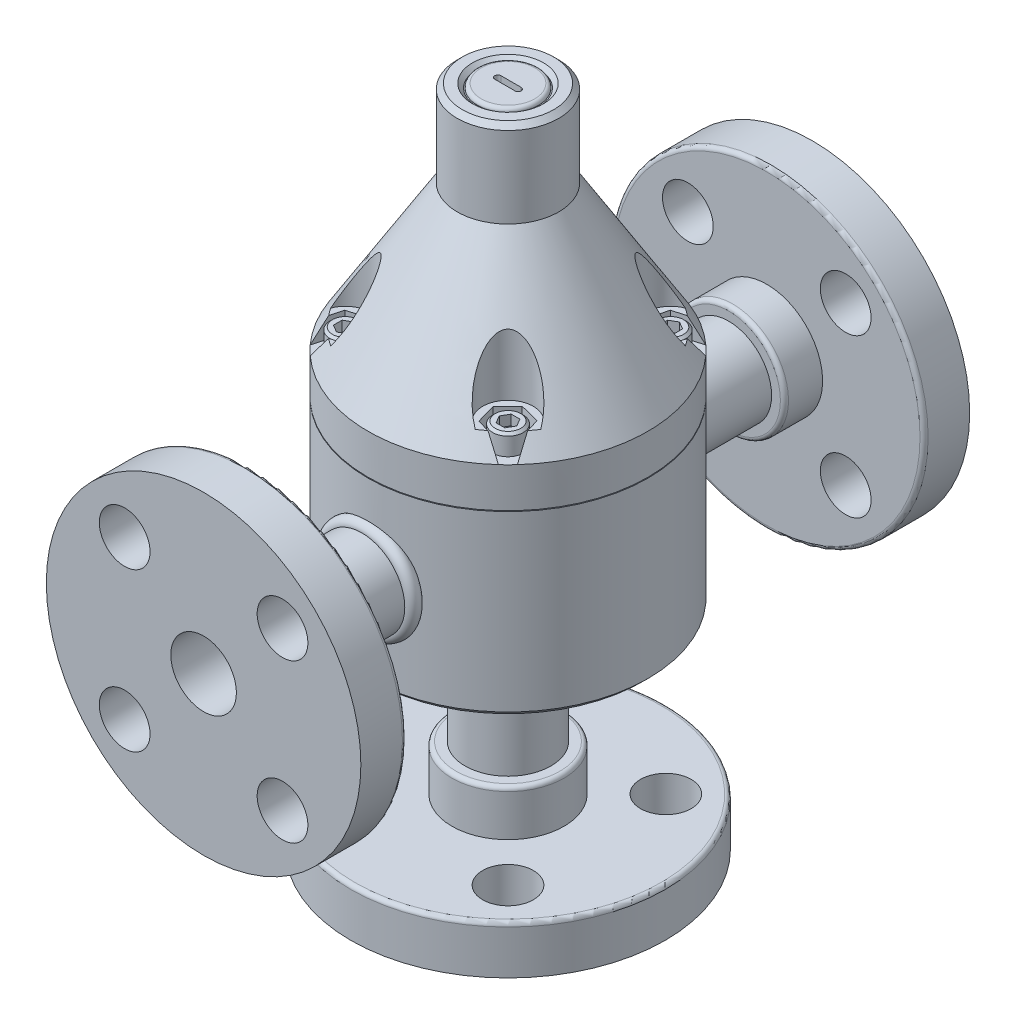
from build123d import *

# Parameters (mm, degrees)
SKETCH1_R                = 43.815
EXTRUDE1_DEPTH           = 140.97
SKETCH3_R                = 11.1125
EXTRUDE2_DEPTH           = 1.27
EXTRUDE2_DRAFT           = -45
CHAMFER1_SIZE            = 1.5748
SKETCH4_R                = 9.525
EXTRUDE3_DEPTH           = 1.27
FILLET1_R                = 1.143
EXTRUDE4_DEPTH           = 3.302
EXTRUDE4_DRAFT           = -1
SKETCH6_R                = 7.9375
EXTRUDE5_DEPTH           = 22.86
EXTRUDE6_DEPTH           = 6.35
CIRPATTERN1_COUNT        = 4
SKETCH9_R                = 4.7625
EXTRUDE7_DEPTH           = 6.35
EXTRUDE8_DEPTH           = 3.175
CIRPATTERN2_COUNT        = 4
CHAMFER2_SIZE            = 0.762
SKETCH11_R               = 49.2125
BOSS_EXTRUDE1_DEPTH      = 14.2748
SKETCH12_R               = 17.4625
BOSS_EXTRUDE2_DEPTH      = 26.2128
BOSS_EXTRUDE3_REACH      = 206.043
BOSS_EXTRUDE3_END_RADIUS = 43.815
SKETCH13_R               = 13.4366
SKETCH14_R               = 10.2616
CUT_EXTRUDE1_DEPTH       = 25.4
SKETCH15_R               = 7.9375
CUT_EXTRUDE2_DEPTH       = 25.4
CIRPATTERN3_COUNT        = 4
SKETCH18_R               = 49.2125
BOSS_EXTRUDE5_DEPTH      = 14.2748
BOSS_EXTRUDE6_START      = 26.2128
SKETCH19_R               = 17.4625
BOSS_EXTRUDE6_DEPTH      = 26.2128
BOSS_EXTRUDE7_REACH      = 244.043
BOSS_EXTRUDE7_END_RADIUS = 43.815
SKETCH20_R               = 13.4366
CUT_EXTRUDE3_START       = 25.4
SKETCH21_R               = 10.2616
CUT_EXTRUDE3_DEPTH       = 25.4
CUT_EXTRUDE4_START       = 25.4
SKETCH22_R               = 7.9375
CUT_EXTRUDE4_DEPTH       = 25.4
CIRPATTERN4_COUNT        = 4
FILLET3_R                = 1.27
SKETCH23_R               = 49.2125
BOSS_EXTRUDE8_DEPTH      = 15.0622
SKETCH24_R               = 17.526
BOSS_EXTRUDE9_DEPTH      = 29.3624
SKETCH25_R               = 13.4366
BOSS_EXTRUDE10_DEPTH     = 66.675
SKETCH26_R               = 10.2616
CUT_EXTRUDE5_DEPTH       = 25.4
FILLET4_R                = 1.27
SKETCH27_R               = 7.9375
CUT_EXTRUDE6_DEPTH       = 25.4
CIRPATTERN5_COUNT        = 4


with BuildPart() as part:
    # Sketch1 → Extrude1 (new body)
    with BuildSketch(Plane(origin=(0, 0, 0), x_dir=(1, 0, 0), z_dir=(0, 1, 0))):
        with Locations(Location((0, 0, 0), (0, 0, 270))):
            Circle(SKETCH1_R)
    extrude(amount=EXTRUDE1_DEPTH)

    # Sketch2 → Cut-Revolve1 (revolve, cut)
    with BuildSketch(Plane.XY, mode=Mode.PRIVATE) as cut_revolve1_sk:
        Polygon((-43.815, 56.134), (-43.815, 68.58), (-15.875, 114.046), (-15.875, 147.034008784), (-49.44729897, 147.034008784), (-49.44729897, 55.88), (-30.226, 55.88), (-30.226, 56.134), align=None)
    revolve(cut_revolve1_sk.sketch.rotate(Axis((0, 0, 0), (0, 1, 0)), 270), axis=Axis((0, 0, 0), (0, 1, 0)), mode=Mode.SUBTRACT)


with BuildPart() as extrude2_tool:
    # Sketch3 → Extrude2 (with draft: the straight prism first)
    with BuildSketch(Plane(origin=(0, 140.97, 0), x_dir=(-1, 0, 0), z_dir=(0, 1, 0))):
        Circle(SKETCH3_R)
    extrude(amount=-EXTRUDE2_DEPTH)
    # Extrude2: the draft: its side faces are tilted about the plane it starts from
    extrude2_sides = [extrude2_tool.faces().sort_by_distance(p)[0] for p in [
        (11.1125, 140.335, 0),
    ]]
    draft(extrude2_sides, Plane(origin=(0, 140.97, 0), x_dir=(-1, 0, 0), z_dir=(0, 1, 0)), EXTRUDE2_DRAFT)


with BuildPart() as part_1:
    add(part.part)

    # Extrude2: cut by extrude2_tool
    add(extrude2_tool.part, mode=Mode.SUBTRACT)

    # Chamfer1
    chamfer1_edges = [part_1.edges().sort_by_distance(p)[0] for p in [
        (0, 0, -43.815),
        (0, 140.97, 15.875),
    ]]
    chamfer(chamfer1_edges, length=CHAMFER1_SIZE)

    # Sketch4 → Extrude3 (add)
    with BuildSketch(Plane(origin=(0, 140.97, 0), x_dir=(-1, 0, 0), z_dir=(0, 1, 0))):
        with Locations(Location((0, 0, 0), (0, 0, 90))):
            Circle(SKETCH4_R)
    extrude(amount=-EXTRUDE3_DEPTH)

    # Fillet1
    fillet1_edges = [part_1.edges().sort_by_distance(p)[0] for p in [
        (0, 140.97, -9.525),
    ]]
    fillet(fillet1_edges, radius=FILLET1_R)


with BuildPart() as extrude4_tool:
    # Sketch5 → Extrude4 (with draft: the straight prism first)
    with BuildSketch(Plane(origin=(0, 140.97, 0), x_dir=(-1, 0, 0), z_dir=(0, 1, 0))):
        with BuildLine():
            Line((3.175, 0.9652), (-3.175, 0.9652))
            ThreePointArc((-3.175, 0.9652), (-4.1402, 0), (-3.175, -0.9652))
            Line((-3.175, -0.9652), (3.175, -0.9652))
            ThreePointArc((3.175, -0.9652), (4.1402, 0), (3.175, 0.9652))
        make_face()
    extrude(amount=-EXTRUDE4_DEPTH)
    # Extrude4: the draft: its side faces are tilted about the plane it starts from
    extrude4_sides = [extrude4_tool.faces().sort_by_distance(p)[0] for p in [
        (-4.1402, 139.319, 0),
        (0, 139.319, 0.9652),
        (4.1402, 139.319, 0),
        (0, 139.319, -0.9652),
    ]]
    draft(extrude4_sides, Plane(origin=(0, 140.97, 0), x_dir=(-1, 0, 0), z_dir=(0, 1, 0)), EXTRUDE4_DRAFT)


with BuildPart() as part_2:
    add(part_1.part)

    # Extrude4: cut by extrude4_tool
    add(extrude4_tool.part, mode=Mode.SUBTRACT)

    # Sketch6 → Extrude5 (cut)
    with BuildSketch(Plane(origin=(0, 74.93, 0), x_dir=(-1, 0, 0), z_dir=(0, 1, 0))):
        with Locations((-25.459026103, 25.459026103)):
            Circle(SKETCH6_R)
    extrude5 = extrude(amount=EXTRUDE5_DEPTH, mode=Mode.SUBTRACT)

    # Sketch8 → Extrude6 (cut)
    with BuildSketch(Plane(origin=(0, 74.93, 0), x_dir=(-1, 0, 0), z_dir=(0, 1, 0))):
        Polygon((-29.948607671, 20.824591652), (-23.690278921, 19.253717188), (-19.200697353, 23.888151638), (-20.969444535, 30.093460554), (-33.591654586, 33.591654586), align=None)
    extrude6 = extrude(amount=-EXTRUDE6_DEPTH, mode=Mode.SUBTRACT)

    # CirPattern1: Extrude5, Extrude6 ×4 about axis
    cirpattern1_axis = Axis((0, 0, 0), (0, 1, 0))
    add([extrude5.rotate(cirpattern1_axis, i * 360 / CIRPATTERN1_COUNT) for i in range(1, CIRPATTERN1_COUNT)], mode=Mode.SUBTRACT)
    add([extrude6.rotate(cirpattern1_axis, i * 360 / CIRPATTERN1_COUNT) for i in range(1, CIRPATTERN1_COUNT)], mode=Mode.SUBTRACT)

    # Sketch9 → Extrude7 (add)
    with BuildSketch(Plane(origin=(0, 74.93, 0), x_dir=(-1, 0, 0), z_dir=(0, 1, 0))):
        with Locations(Location((-25.459026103, 25.459026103, 0), (0, 0, 90))):
            Circle(SKETCH9_R)
    extrude7 = extrude(amount=-EXTRUDE7_DEPTH)

    # Sketch10 → Extrude8 (cut)
    with BuildSketch(Plane(origin=(0, 74.93, 0), x_dir=(-1, 0, 0), z_dir=(0, 1, 0))):
        Polygon((-28.187127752, 25.459026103), (-26.823076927, 23.096420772), (-24.094975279, 23.096420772), (-22.730924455, 25.459026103), (-24.094975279, 27.821631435), (-26.823076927, 27.821631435), align=None)
    extrude8 = extrude(amount=-EXTRUDE8_DEPTH, mode=Mode.SUBTRACT)

    # CirPattern2: Extrude7, Extrude8 ×4 about axis
    cirpattern2_axis = Axis((0, 0, 0), (0, 1, 0))
    add([extrude7.rotate(cirpattern2_axis, i * 360 / CIRPATTERN2_COUNT) for i in range(1, CIRPATTERN2_COUNT)])
    add([extrude8.rotate(cirpattern2_axis, i * 360 / CIRPATTERN2_COUNT) for i in range(1, CIRPATTERN2_COUNT)], mode=Mode.SUBTRACT)

    # Chamfer2
    chamfer2_edges = [part_2.edges().sort_by_distance(p)[0] for p in [
        (25.459026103, 74.93, 20.696526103),
        (-20.696526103, 74.93, 25.459026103),
        (-25.459026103, 74.93, -20.696526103),
        (20.696526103, 74.93, -25.459026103),
    ]]
    chamfer(chamfer2_edges, length=CHAMFER2_SIZE)



with BuildPart() as body_2:
    # Sketch11 → Boss-Extrude1 (new body)
    with BuildSketch(Plane.XY.offset(95.25)):
        with Locations((0, 28.575)):
            Circle(SKETCH11_R)
    extrude(amount=-BOSS_EXTRUDE1_DEPTH)

    # Sketch12 → Boss-Extrude2 (add)
    with BuildSketch(Plane.XY.offset(95.25)):
        with Locations((0, 28.575)):
            Circle(SKETCH12_R)
    extrude(amount=-BOSS_EXTRUDE2_DEPTH)


with BuildPart() as part_3:
    add(part_2.part)

    add(body_2.part)  # Boss-Extrude3 merges body 2
    # Boss-Extrude3: up to this cylinder (the profile starts outside it)
    boss_extrude3_end = Plane(origin=(0, 28.575, 0), z_dir=(0, -1, 0)) * Cylinder(BOSS_EXTRUDE3_END_RADIUS, 500.716, mode=Mode.PRIVATE)
    # Sketch13 → Boss-Extrude3 (add, up to the surface)
    with BuildSketch(Plane.XY.offset(95.25), mode=Mode.PRIVATE) as boss_extrude3_sk1:
        with Locations((0, 28.575)):
            Circle(SKETCH13_R)
    boss_extrude3_tool1 = extrude(boss_extrude3_sk1.sketch, amount=-BOSS_EXTRUDE3_REACH, mode=Mode.PRIVATE) - boss_extrude3_end
    add(boss_extrude3_tool1.solids().sort_by_distance((0, 28.575, 95.25))[0])

    # Sketch14 → Cut-Extrude1 (cut)
    with BuildSketch(Plane.XY.offset(95.25)):
        with Locations((0, 28.575)):
            Circle(SKETCH14_R)
    extrude(amount=-CUT_EXTRUDE1_DEPTH, mode=Mode.SUBTRACT)

    # Sketch15 → Cut-Extrude2 (cut)
    with BuildSketch(Plane.XY.offset(95.25)):
        with Locations((-24.695704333, 53.270704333)):
            Circle(SKETCH15_R)
    cut_extrude2 = extrude(amount=-CUT_EXTRUDE2_DEPTH, mode=Mode.SUBTRACT)

    # CirPattern3: Cut-Extrude2 ×4 about axis
    cirpattern3_axis = Axis((0, 28.575, 0), (0, 0, 1))
    for i in range(1, CIRPATTERN3_COUNT):
        add(cut_extrude2.rotate(cirpattern3_axis, i * 360 / CIRPATTERN3_COUNT), mode=Mode.SUBTRACT)

    # Sketch16 → Revolve1 (revolve)
    with BuildSketch(Plane(origin=(0, 0, 0), x_dir=(0, 0, -1), z_dir=(1, 0, 0)), mode=Mode.PRIVATE) as revolve1_sk:
        with BuildLine():
            Line((-41.255708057, 38.10228525), (-45.737066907, 38.10228525))
            Line((-45.737066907, 38.10228525), (-45.737066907, 42.0116))
            ThreePointArc((-45.737066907, 42.0116), (-43.699332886, 44.263475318), (-41.255708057, 42.460145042))
            Line((-41.255708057, 42.460145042), (-41.255708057, 38.10228525))
        make_face()
    revolve1 = revolve(revolve1_sk.sketch.rotate(Axis((0, 28.575, 95.25), (0, 0, -1)), 90), axis=Axis((0, 28.575, 95.25), (0, 0, -1)))



with BuildPart() as body_2_2:
    # Sketch18 → Boss-Extrude5 (new body)
    with BuildSketch(Plane.XY.offset(-95.25)):
        with Locations((0, 28.575)):
            Circle(SKETCH18_R)
    extrude(amount=BOSS_EXTRUDE5_DEPTH)

    # Sketch19 → Boss-Extrude6 (add)
    with BuildSketch(Plane.XY.offset(-95.25).offset(BOSS_EXTRUDE6_START)):
        with Locations((0, 28.575)):
            Circle(SKETCH19_R)
    extrude(amount=-BOSS_EXTRUDE6_DEPTH)


with BuildPart() as part_4:
    add(part_3.part)

    add(body_2_2.part)  # Boss-Extrude7 merges body 2 2
    # Boss-Extrude7: up to this cylinder (the profile starts outside it)
    boss_extrude7_end = Plane(origin=(0, 28.575, 0), z_dir=(0, -1, 0)) * Cylinder(BOSS_EXTRUDE7_END_RADIUS, 576.716, mode=Mode.PRIVATE)
    # Sketch20 → Boss-Extrude7 (add, up to the surface)
    with BuildSketch(Plane.XY.offset(-95.25), mode=Mode.PRIVATE) as boss_extrude7_sk1:
        with Locations((0, 28.575)):
            Circle(SKETCH20_R)
    boss_extrude7_tool1 = extrude(boss_extrude7_sk1.sketch, amount=BOSS_EXTRUDE7_REACH, mode=Mode.PRIVATE) - boss_extrude7_end
    add(boss_extrude7_tool1.solids().sort_by_distance((0, 28.575, -95.25))[0])

    # Sketch21 → Cut-Extrude3 (cut)
    with BuildSketch(Plane.XY.offset(-95.25).offset(CUT_EXTRUDE3_START)):
        with Locations((0, 28.575)):
            Circle(SKETCH21_R)
    extrude(amount=-CUT_EXTRUDE3_DEPTH, mode=Mode.SUBTRACT)

    # Sketch22 → Cut-Extrude4 (cut)
    with BuildSketch(Plane.XY.offset(-95.25).offset(CUT_EXTRUDE4_START)):
        with Locations((24.695704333, 53.270704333)):
            Circle(SKETCH22_R)
    cut_extrude4 = extrude(amount=-CUT_EXTRUDE4_DEPTH, mode=Mode.SUBTRACT)

    # CirPattern4: Cut-Extrude4 ×4 about axis
    cirpattern4_axis = Axis((0, 28.575, 0), (0, 0, 1))
    for i in range(1, CIRPATTERN4_COUNT):
        add(cut_extrude4.rotate(cirpattern4_axis, i * 360 / CIRPATTERN4_COUNT), mode=Mode.SUBTRACT)

    # Fillet3
    fillet3_edges = [part_4.edges().sort_by_distance(p)[0] for p in [
        (-49.2125, 28.575, 80.9752),
        (-17.4625, 28.575, 69.0372),
        (-17.4625, 28.575, -69.0372),
        (-49.2125, 28.575, -80.9752),
    ]]
    fillet(fillet3_edges, radius=FILLET3_R)

    # Mirror1: Revolve1 across plane
    add(revolve1.mirror(Plane.XY))



with BuildPart() as body_2_3:
    # Sketch23 → Boss-Extrude8 (new body)
    with BuildSketch(Plane(origin=(0, -66.675, 0), x_dir=(1, 0, 0), z_dir=(0, 1, 0))):
        with Locations(Location((0, 0, 0), (0, 0, 270))):
            Circle(SKETCH23_R)
    extrude(amount=BOSS_EXTRUDE8_DEPTH)

    # Sketch24 → Boss-Extrude9 (add)
    with BuildSketch(Plane(origin=(0, -66.675, 0), x_dir=(1, 0, 0), z_dir=(0, 1, 0))):
        with Locations(Location((0, 0, 0), (0, 0, 270))):
            Circle(SKETCH24_R)
    extrude(amount=BOSS_EXTRUDE9_DEPTH)


with BuildPart() as part_5:
    add(part_4.part)

    add(body_2_3.part)  # Boss-Extrude10 merges body 2 3
    # Sketch25 → Boss-Extrude10 (add)
    with BuildSketch(Plane(origin=(0, -66.675, 0), x_dir=(1, 0, 0), z_dir=(0, 1, 0))):
        with Locations(Location((0, 0, 0), (0, 0, 90))):
            Circle(SKETCH25_R)
    extrude(amount=BOSS_EXTRUDE10_DEPTH)

    # Sketch26 → Cut-Extrude5 (cut)
    with BuildSketch(Plane(origin=(0, -66.675, 0), x_dir=(1, 0, 0), z_dir=(0, 1, 0))):
        with Locations(Location((0, 0, 0), (0, 0, 270))):
            Circle(SKETCH26_R)
    extrude(amount=CUT_EXTRUDE5_DEPTH, mode=Mode.SUBTRACT)

    # Fillet4
    fillet4_edges = [part_5.edges().sort_by_distance(p)[0] for p in [
        (0, -37.3126, -17.526),
        (0, -51.6128, -49.2125),
    ]]
    fillet(fillet4_edges, radius=FILLET4_R)

    # Sketch27 → Cut-Extrude6 (cut)
    with BuildSketch(Plane(origin=(0, -66.675, 0), x_dir=(1, 0, 0), z_dir=(0, 1, 0))):
        with Locations(Location((-24.695704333, -24.695704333, 0), (0, 0, 270))):
            Circle(SKETCH27_R)
    cut_extrude6 = extrude(amount=CUT_EXTRUDE6_DEPTH, mode=Mode.SUBTRACT)

    # CirPattern5: Cut-Extrude6 ×4 about axis
    cirpattern5_axis = Axis((0, 0, 0), (0, 1, 0))
    for i in range(1, CIRPATTERN5_COUNT):
        add(cut_extrude6.rotate(cirpattern5_axis, i * 360 / CIRPATTERN5_COUNT), mode=Mode.SUBTRACT)

    # Sketch28 → Revolve2 (revolve)
    with BuildSketch(Plane(origin=(0, 0, 0), x_dir=(0, 0, -1), z_dir=(1, 0, 0))):
        with BuildLine():
            Line((-16.6116, 0.846032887), (-16.6116, 3.72280431))
            Line((-16.6116, 3.72280431), (-10.335007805, 3.72280431))
            Line((-10.335007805, 3.72280431), (-10.335007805, -3.175))
            ThreePointArc((-10.335007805, -3.175), (-14.524550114, -2.805416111), (-16.6116, 0.846032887))
        make_face()
    revolve(axis=Axis((0, 0, 0), (0, -1, 0)))


solid = part_5.part
